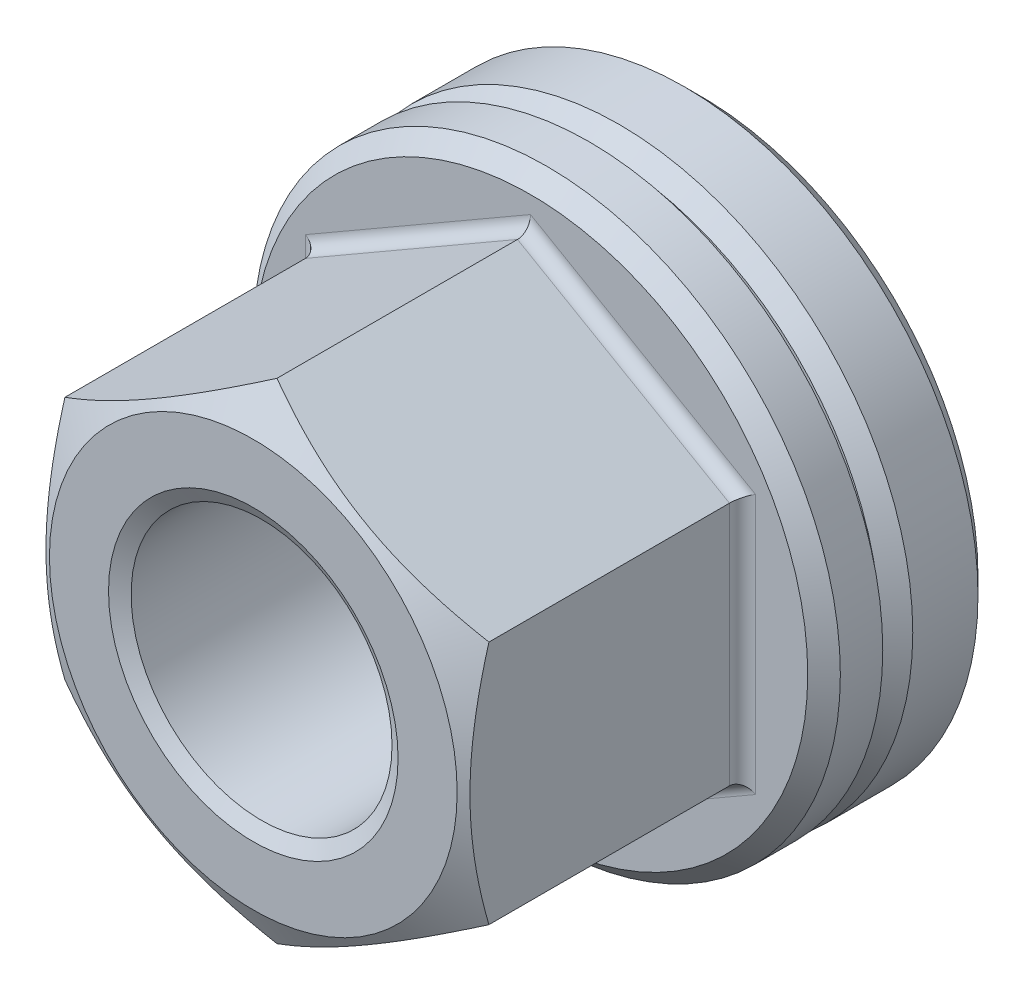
ISO-10303-21;
HEADER;
FILE_DESCRIPTION(('STEP AP214'),'2;1');
FILE_NAME('part.step','',(''),(''),'','','');
FILE_SCHEMA(('AUTOMOTIVE_DESIGN { 1 0 10303 214 1 1 1 1 }'));
ENDSEC;
DATA;
#1=APPLICATION_CONTEXT('core data for automotive mechanical design processes');
#2=APPLICATION_PROTOCOL_DEFINITION('international standard','automotive_design',2000,#1);
#3=PRODUCT_CONTEXT('',#1,'mechanical');
#4=PRODUCT('Part','Part','',(#3));
#5=PRODUCT_RELATED_PRODUCT_CATEGORY('part','',(#4));
#6=PRODUCT_DEFINITION_FORMATION('','',#4);
#7=PRODUCT_DEFINITION_CONTEXT('part definition',#1,'design');
#8=PRODUCT_DEFINITION('design','',#6,#7);
#9=PRODUCT_DEFINITION_SHAPE('','',#8);
#10=(LENGTH_UNIT() NAMED_UNIT(*) SI_UNIT(.MILLI.,.METRE.));
#11=(NAMED_UNIT(*) PLANE_ANGLE_UNIT() SI_UNIT($,.RADIAN.));
#12=(NAMED_UNIT(*) SI_UNIT($,.STERADIAN.) SOLID_ANGLE_UNIT());
#13=UNCERTAINTY_MEASURE_WITH_UNIT(LENGTH_MEASURE(1.E-05),#10,'distance_accuracy_value','');
#14=(GEOMETRIC_REPRESENTATION_CONTEXT(3) GLOBAL_UNCERTAINTY_ASSIGNED_CONTEXT((#13)) GLOBAL_UNIT_ASSIGNED_CONTEXT((#10,
#11,#12)) REPRESENTATION_CONTEXT('',''));
#15=CARTESIAN_POINT('',(0.,0.,0.));
#16=DIRECTION('',(0.,0.,1.));
#17=DIRECTION('',(1.,0.,0.));
#18=AXIS2_PLACEMENT_3D('',#15,#16,#17);
#19=CARTESIAN_POINT('',(0.,0.,3.));
#20=DIRECTION('',(0.,0.,1.));
#21=DIRECTION('',(1.,0.,0.));
#22=AXIS2_PLACEMENT_3D('',#19,#20,#21);
#23=PLANE('',#22);
#24=CARTESIAN_POINT('',(0.,0.,3.));
#25=DIRECTION('',(0.,0.,1.));
#26=DIRECTION('',(1.,0.,0.));
#27=AXIS2_PLACEMENT_3D('',#24,#25,#26);
#28=CIRCLE('',#27,8.5);
#29=CARTESIAN_POINT('',(8.5,0.,3.));
#30=VERTEX_POINT('',#29);
#31=EDGE_CURVE('E558',#30,#30,#28,.T.);
#32=ORIENTED_EDGE('',*,*,#31,.T.);
#33=EDGE_LOOP('',(#32));
#34=FACE_BOUND('',#33,.T.);
#35=CARTESIAN_POINT('',(0.,0.,3.));
#36=DIRECTION('',(0.,0.,1.));
#37=DIRECTION('',(1.,0.,0.));
#38=AXIS2_PLACEMENT_3D('',#35,#36,#37);
#39=CIRCLE('',#38,8.11247891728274);
#40=CARTESIAN_POINT('',(0.,8.1124789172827,3.));
#41=VERTEX_POINT('',#40);
#42=EDGE_CURVE('E9',#41,#41,#39,.F.);
#43=ORIENTED_EDGE('',*,*,#42,.T.);
#44=EDGE_LOOP('',(#43));
#45=FACE_BOUND('',#44,.T.);
#46=ADVANCED_FACE('F14',(#34,#45),#23,.T.);
#47=CARTESIAN_POINT('',(0.,0.,27.0416305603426));
#48=DIRECTION('',(0.,0.,-1.));
#49=DIRECTION('',(-1.,0.,0.));
#50=AXIS2_PLACEMENT_3D('',#47,#48,#49);
#51=CYLINDRICAL_SURFACE('',#50,5.25);
#52=CARTESIAN_POINT('',(0.,0.,1.90808929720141));
#53=DIRECTION('',(0.,0.,1.));
#54=DIRECTION('',(1.,0.,0.));
#55=AXIS2_PLACEMENT_3D('',#52,#53,#54);
#56=CIRCLE('',#55,5.25);
#57=CARTESIAN_POINT('',(5.25,0.,1.90808929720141));
#58=VERTEX_POINT('',#57);
#59=EDGE_CURVE('E153',#58,#58,#56,.T.);
#60=ORIENTED_EDGE('',*,*,#59,.F.);
#61=EDGE_LOOP('',(#60));
#62=FACE_BOUND('',#61,.T.);
#63=CARTESIAN_POINT('',(0.,0.,1.9821611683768));
#64=DIRECTION('',(0.,0.,1.));
#65=DIRECTION('',(1.,0.,0.));
#66=AXIS2_PLACEMENT_3D('',#63,#64,#65);
#67=CIRCLE('',#66,5.25);
#68=CARTESIAN_POINT('',(0.,5.24999999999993,1.9821611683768));
#69=VERTEX_POINT('',#68);
#70=EDGE_CURVE('E22',#69,#69,#67,.F.);
#71=ORIENTED_EDGE('',*,*,#70,.F.);
#72=EDGE_LOOP('',(#71));
#73=FACE_BOUND('',#72,.T.);
#74=ADVANCED_FACE('F418',(#62,#73),#51,.F.);
#75=CARTESIAN_POINT('',(0.,0.,1.7261041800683));
#76=DIRECTION('',(0.,0.,1.));
#77=DIRECTION('',(1.,0.,0.));
#78=AXIS2_PLACEMENT_3D('',#75,#76,#77);
#79=CONICAL_SURFACE('',#78,4.75,1.22173047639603);
#80=CARTESIAN_POINT('',(0.,0.,1.7261041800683));
#81=DIRECTION('',(0.,0.,1.));
#82=DIRECTION('',(1.,0.,0.));
#83=AXIS2_PLACEMENT_3D('',#80,#81,#82);
#84=CIRCLE('',#83,4.75);
#85=CARTESIAN_POINT('',(4.75,0.,1.7261041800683));
#86=VERTEX_POINT('',#85);
#87=EDGE_CURVE('E577',#86,#86,#84,.T.);
#88=ORIENTED_EDGE('',*,*,#87,.F.);
#89=EDGE_LOOP('',(#88));
#90=FACE_BOUND('',#89,.T.);
#91=ORIENTED_EDGE('',*,*,#59,.T.);
#92=EDGE_LOOP('',(#91));
#93=FACE_BOUND('',#92,.T.);
#94=ADVANCED_FACE('F409',(#90,#93),#79,.F.);
#95=CARTESIAN_POINT('',(0.,0.,0.));
#96=DIRECTION('',(0.,0.,1.));
#97=DIRECTION('',(1.,0.,0.));
#98=AXIS2_PLACEMENT_3D('',#95,#96,#97);
#99=PLANE('',#98);
#100=CARTESIAN_POINT('',(0.,0.,0.));
#101=DIRECTION('',(0.,0.,1.));
#102=DIRECTION('',(1.,0.,0.));
#103=AXIS2_PLACEMENT_3D('',#100,#101,#102);
#104=CIRCLE('',#103,5.25);
#105=CARTESIAN_POINT('',(5.25,0.,0.));
#106=VERTEX_POINT('',#105);
#107=EDGE_CURVE('E571',#106,#106,#104,.T.);
#108=ORIENTED_EDGE('',*,*,#107,.T.);
#109=EDGE_LOOP('',(#108));
#110=FACE_BOUND('',#109,.T.);
#111=CARTESIAN_POINT('',(0.,0.,0.));
#112=DIRECTION('',(0.,0.,1.));
#113=DIRECTION('',(1.,0.,0.));
#114=AXIS2_PLACEMENT_3D('',#111,#112,#113);
#115=CIRCLE('',#114,8.5);
#116=CARTESIAN_POINT('',(8.5,0.,0.));
#117=VERTEX_POINT('',#116);
#118=EDGE_CURVE('E574',#117,#117,#115,.F.);
#119=ORIENTED_EDGE('',*,*,#118,.T.);
#120=EDGE_LOOP('',(#119));
#121=FACE_BOUND('',#120,.T.);
#122=ADVANCED_FACE('F400',(#110,#121),#99,.F.);
#123=CARTESIAN_POINT('',(0.,0.,3.));
#124=DIRECTION('',(0.,0.,-1.));
#125=DIRECTION('',(-1.,0.,0.));
#126=AXIS2_PLACEMENT_3D('',#123,#124,#125);
#127=CYLINDRICAL_SURFACE('',#126,9.);
#128=CARTESIAN_POINT('',(0.,0.,0.5));
#129=DIRECTION('',(0.,0.,1.));
#130=DIRECTION('',(1.,0.,0.));
#131=AXIS2_PLACEMENT_3D('',#128,#129,#130);
#132=CIRCLE('',#131,9.);
#133=CARTESIAN_POINT('',(9.,0.,0.5));
#134=VERTEX_POINT('',#133);
#135=EDGE_CURVE('E560',#134,#134,#132,.T.);
#136=ORIENTED_EDGE('',*,*,#135,.T.);
#137=EDGE_LOOP('',(#136));
#138=FACE_BOUND('',#137,.T.);
#139=CARTESIAN_POINT('',(0.,0.,2.5));
#140=DIRECTION('',(0.,0.,1.));
#141=DIRECTION('',(1.,0.,0.));
#142=AXIS2_PLACEMENT_3D('',#139,#140,#141);
#143=CIRCLE('',#142,9.);
#144=CARTESIAN_POINT('',(9.,0.,2.5));
#145=VERTEX_POINT('',#144);
#146=EDGE_CURVE('E563',#145,#145,#143,.F.);
#147=ORIENTED_EDGE('',*,*,#146,.T.);
#148=EDGE_LOOP('',(#147));
#149=FACE_BOUND('',#148,.T.);
#150=ADVANCED_FACE('F391',(#138,#149),#127,.T.);
#151=CARTESIAN_POINT('',(0.,0.,4.16940303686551));
#152=DIRECTION('',(0.,0.,1.));
#153=DIRECTION('',(1.,0.,0.));
#154=AXIS2_PLACEMENT_3D('',#151,#152,#153);
#155=CYLINDRICAL_SURFACE('',#154,4.75);
#156=CARTESIAN_POINT('',(0.,0.,0.500000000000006));
#157=DIRECTION('',(0.,0.,1.));
#158=DIRECTION('',(1.,0.,0.));
#159=AXIS2_PLACEMENT_3D('',#156,#157,#158);
#160=CIRCLE('',#159,4.75);
#161=CARTESIAN_POINT('',(4.75,0.,0.500000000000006));
#162=VERTEX_POINT('',#161);
#163=EDGE_CURVE('E568',#162,#162,#160,.F.);
#164=ORIENTED_EDGE('',*,*,#163,.T.);
#165=EDGE_LOOP('',(#164));
#166=FACE_BOUND('',#165,.T.);
#167=ORIENTED_EDGE('',*,*,#87,.T.);
#168=EDGE_LOOP('',(#167));
#169=FACE_BOUND('',#168,.T.);
#170=ADVANCED_FACE('F382',(#166,#169),#155,.F.);
#171=CARTESIAN_POINT('',(0.,0.,0.));
#172=DIRECTION('',(0.,0.,-1.));
#173=DIRECTION('',(-1.,0.,0.));
#174=AXIS2_PLACEMENT_3D('',#171,#172,#173);
#175=CONICAL_SURFACE('',#174,5.25,0.785398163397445);
#176=ORIENTED_EDGE('',*,*,#163,.F.);
#177=EDGE_LOOP('',(#176));
#178=FACE_BOUND('',#177,.T.);
#179=ORIENTED_EDGE('',*,*,#107,.F.);
#180=EDGE_LOOP('',(#179));
#181=FACE_BOUND('',#180,.T.);
#182=ADVANCED_FACE('F373',(#178,#181),#175,.F.);
#183=CARTESIAN_POINT('',(0.,0.,0.5));
#184=DIRECTION('',(0.,0.,1.));
#185=DIRECTION('',(1.,0.,0.));
#186=AXIS2_PLACEMENT_3D('',#183,#184,#185);
#187=CONICAL_SURFACE('',#186,9.,0.785398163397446);
#188=ORIENTED_EDGE('',*,*,#118,.F.);
#189=EDGE_LOOP('',(#188));
#190=FACE_BOUND('',#189,.T.);
#191=ORIENTED_EDGE('',*,*,#135,.F.);
#192=EDGE_LOOP('',(#191));
#193=FACE_BOUND('',#192,.T.);
#194=ADVANCED_FACE('F364',(#190,#193),#187,.T.);
#195=CARTESIAN_POINT('',(0.,0.,3.));
#196=DIRECTION('',(0.,0.,-1.));
#197=DIRECTION('',(-1.,0.,0.));
#198=AXIS2_PLACEMENT_3D('',#195,#196,#197);
#199=CONICAL_SURFACE('',#198,8.5,0.785398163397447);
#200=ORIENTED_EDGE('',*,*,#146,.F.);
#201=EDGE_LOOP('',(#200));
#202=FACE_BOUND('',#201,.T.);
#203=ORIENTED_EDGE('',*,*,#31,.F.);
#204=EDGE_LOOP('',(#203));
#205=FACE_BOUND('',#204,.T.);
#206=ADVANCED_FACE('F219',(#202,#205),#199,.T.);
#207=CARTESIAN_POINT('',(-6.5,-3.75277674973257,13.7202299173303));
#208=DIRECTION('',(0.5,0.866025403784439,0.));
#209=DIRECTION('',(-0.866025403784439,0.5,0.));
#210=AXIS2_PLACEMENT_3D('',#207,#208,#209);
#211=PLANE('',#210);
#212=DIRECTION('',(0.,0.,-1.));
#213=VECTOR('',#212,1.);
#214=CARTESIAN_POINT('',(-6.5,-3.75277674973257,13.7202299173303));
#215=LINE('',#214,#213);
#216=CARTESIAN_POINT('',(-6.5,-3.75277674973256,12.9956553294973));
#217=VERTEX_POINT('',#216);
#218=CARTESIAN_POINT('',(-6.5,-3.75277674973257,5.62022991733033));
#219=VERTEX_POINT('',#218);
#220=EDGE_CURVE('E105',#217,#219,#215,.T.);
#221=ORIENTED_EDGE('',*,*,#220,.T.);
#222=DIRECTION('',(0.866025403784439,-0.5,0.));
#223=VECTOR('',#222,1.);
#224=CARTESIAN_POINT('',(-6.5,-3.75277674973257,5.62022991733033));
#225=LINE('',#224,#223);
#226=CARTESIAN_POINT('',(0.,-7.50555349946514,5.62022991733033));
#227=VERTEX_POINT('',#226);
#228=EDGE_CURVE('E147',#219,#227,#225,.T.);
#229=ORIENTED_EDGE('',*,*,#228,.T.);
#230=DIRECTION('',(0.,0.,-1.));
#231=VECTOR('',#230,1.);
#232=CARTESIAN_POINT('',(0.,-7.50555349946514,13.7202299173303));
#233=LINE('',#232,#231);
#234=CARTESIAN_POINT('',(0.,-7.50555349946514,12.9956553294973));
#235=VERTEX_POINT('',#234);
#236=EDGE_CURVE('E116',#235,#227,#233,.T.);
#237=ORIENTED_EDGE('',*,*,#236,.F.);
#238=CARTESIAN_POINT('',(0.000199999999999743,-7.50566896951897,12.9955886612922));
#239=CARTESIAN_POINT('',(-0.14267745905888,-7.4231786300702,13.0432074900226));
#240=CARTESIAN_POINT('',(-0.286087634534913,-7.34038072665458,13.0886652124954));
#241=CARTESIAN_POINT('',(-0.574072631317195,-7.17411251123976,13.1746632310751));
#242=CARTESIAN_POINT('',(-0.718647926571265,-7.09064192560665,13.2152014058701));
#243=CARTESIAN_POINT('',(-1.15468865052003,-6.83889369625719,13.3286409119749));
#244=CARTESIAN_POINT('',(-1.44787528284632,-6.66962231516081,13.3931641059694));
#245=CARTESIAN_POINT('',(-1.88662374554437,-6.41631077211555,13.4688253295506));
#246=CARTESIAN_POINT('',(-2.03087463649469,-6.33302748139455,13.4903790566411));
#247=CARTESIAN_POINT('',(-2.32002821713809,-6.16608458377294,13.526521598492));
#248=CARTESIAN_POINT('',(-2.46493084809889,-6.08242501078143,13.5411110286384));
#249=CARTESIAN_POINT('',(-2.75498777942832,-5.91496056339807,13.5629531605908));
#250=CARTESIAN_POINT('',(-2.90014160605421,-5.83115596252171,13.570214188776));
#251=CARTESIAN_POINT('',(-3.19057533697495,-5.66347396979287,13.5772516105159));
#252=CARTESIAN_POINT('',(-3.33585523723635,-5.5795965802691,13.5770282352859));
#253=CARTESIAN_POINT('',(-3.73387594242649,-5.34979921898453,13.5661284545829));
#254=CARTESIAN_POINT('',(-3.98648646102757,-5.20395446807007,13.5478300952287));
#255=CARTESIAN_POINT('',(-4.49002967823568,-4.91323365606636,13.4898055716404));
#256=CARTESIAN_POINT('',(-4.74096060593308,-4.76835861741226,13.4500595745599));
#257=CARTESIAN_POINT('',(-5.24551722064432,-4.47705272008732,13.350706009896));
#258=CARTESIAN_POINT('',(-5.49907924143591,-4.33065861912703,13.2906774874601));
#259=CARTESIAN_POINT('',(-6.00242193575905,-4.04005357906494,13.1544369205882));
#260=CARTESIAN_POINT('',(-6.25220905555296,-3.89583891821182,13.0782568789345));
#261=CARTESIAN_POINT('',(-6.5002,-3.75266127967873,12.9955886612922));
#262=B_SPLINE_CURVE_WITH_KNOTS('',3,(#238,#239,#240,#241,#242,#243,#244,#245,#246,#247,#248,
#249,#250,#251,#252,#253,#254,#255,#256,#257,#258,#259,#260,#261),.UNSPECIFIED.,.F.,.F.,(4,2,2,
2,2,2,2,2,2,2,2,4),(0.,0.515105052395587,1.03043143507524,2.06322554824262,2.56697389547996,
3.07067772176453,3.57380860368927,4.07692394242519,4.9527935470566,5.82947446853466,
6.72559912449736,7.61996451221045),.UNSPECIFIED.);
#263=EDGE_CURVE('E106',#235,#217,#262,.T.);
#264=ORIENTED_EDGE('',*,*,#263,.T.);
#265=EDGE_LOOP('',(#221,#229,#237,#264));
#266=FACE_BOUND('',#265,.T.);
#267=ADVANCED_FACE('F215',(#266),#211,.F.);
#268=CARTESIAN_POINT('',(0.,-7.50555349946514,13.7202299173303));
#269=DIRECTION('',(-0.5,0.866025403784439,0.));
#270=DIRECTION('',(-0.866025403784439,-0.5,0.));
#271=AXIS2_PLACEMENT_3D('',#268,#269,#270);
#272=PLANE('',#271);
#273=ORIENTED_EDGE('',*,*,#236,.T.);
#274=DIRECTION('',(0.866025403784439,0.5,0.));
#275=VECTOR('',#274,1.);
#276=CARTESIAN_POINT('',(0.,-7.50555349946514,5.62022991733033));
#277=LINE('',#276,#275);
#278=CARTESIAN_POINT('',(6.5,-3.75277674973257,5.62022991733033));
#279=VERTEX_POINT('',#278);
#280=EDGE_CURVE('E37',#227,#279,#277,.T.);
#281=ORIENTED_EDGE('',*,*,#280,.T.);
#282=DIRECTION('',(0.,0.,-1.));
#283=VECTOR('',#282,1.);
#284=CARTESIAN_POINT('',(6.5,-3.75277674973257,13.7202299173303));
#285=LINE('',#284,#283);
#286=CARTESIAN_POINT('',(6.5,-3.75277674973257,12.9956553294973));
#287=VERTEX_POINT('',#286);
#288=EDGE_CURVE('E307',#287,#279,#285,.T.);
#289=ORIENTED_EDGE('',*,*,#288,.F.);
#290=CARTESIAN_POINT('',(6.5002,-3.75266127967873,12.9955886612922));
#291=CARTESIAN_POINT('',(6.35732254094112,-3.83515161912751,13.0432074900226));
#292=CARTESIAN_POINT('',(6.21391236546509,-3.91794952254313,13.0886652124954));
#293=CARTESIAN_POINT('',(5.92592736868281,-4.08421773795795,13.1746632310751));
#294=CARTESIAN_POINT('',(5.78135207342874,-4.16768832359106,13.2152014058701));
#295=CARTESIAN_POINT('',(5.34531134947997,-4.41943655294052,13.3286409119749));
#296=CARTESIAN_POINT('',(5.05212471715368,-4.5887079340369,13.3931641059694));
#297=CARTESIAN_POINT('',(4.61337625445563,-4.84201947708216,13.4688253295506));
#298=CARTESIAN_POINT('',(4.46912536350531,-4.92530276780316,13.4903790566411));
#299=CARTESIAN_POINT('',(4.17997178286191,-5.09224566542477,13.526521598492));
#300=CARTESIAN_POINT('',(4.03506915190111,-5.17590523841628,13.5411110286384));
#301=CARTESIAN_POINT('',(3.74501222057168,-5.34336968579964,13.5629531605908));
#302=CARTESIAN_POINT('',(3.59985839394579,-5.427174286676,13.570214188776));
#303=CARTESIAN_POINT('',(3.30942466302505,-5.59485627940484,13.5772516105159));
#304=CARTESIAN_POINT('',(3.16414476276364,-5.6787336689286,13.5770282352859));
#305=CARTESIAN_POINT('',(2.76612405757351,-5.90853103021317,13.5661284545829));
#306=CARTESIAN_POINT('',(2.51351353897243,-6.05437578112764,13.5478300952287));
#307=CARTESIAN_POINT('',(2.00997032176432,-6.34509659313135,13.4898055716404));
#308=CARTESIAN_POINT('',(1.75903939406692,-6.48997163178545,13.4500595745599));
#309=CARTESIAN_POINT('',(1.25448277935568,-6.78127752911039,13.350706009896));
#310=CARTESIAN_POINT('',(1.00092075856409,-6.92767163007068,13.2906774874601));
#311=CARTESIAN_POINT('',(0.497578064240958,-7.21827667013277,13.1544369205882));
#312=CARTESIAN_POINT('',(0.247790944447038,-7.36249133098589,13.0782568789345));
#313=CARTESIAN_POINT('',(-0.000200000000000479,-7.50566896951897,12.9955886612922));
#314=B_SPLINE_CURVE_WITH_KNOTS('',3,(#290,#291,#292,#293,#294,#295,#296,#297,#298,#299,#300,
#301,#302,#303,#304,#305,#306,#307,#308,#309,#310,#311,#312,#313),.UNSPECIFIED.,.F.,.F.,(4,2,2,
2,2,2,2,2,2,2,2,4),(0.,0.515105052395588,1.03043143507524,2.06322554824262,2.56697389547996,
3.07067772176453,3.57380860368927,4.0769239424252,4.9527935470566,5.82947446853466,
6.72559912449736,7.61996451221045),.UNSPECIFIED.);
#315=EDGE_CURVE('E196',#287,#235,#314,.T.);
#316=ORIENTED_EDGE('',*,*,#315,.T.);
#317=EDGE_LOOP('',(#273,#281,#289,#316));
#318=FACE_BOUND('',#317,.T.);
#319=ADVANCED_FACE('F210',(#318),#272,.F.);
#320=CARTESIAN_POINT('',(6.5,-3.75277674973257,13.7202299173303));
#321=DIRECTION('',(-1.,0.,0.));
#322=DIRECTION('',(0.,-1.,0.));
#323=AXIS2_PLACEMENT_3D('',#320,#321,#322);
#324=PLANE('',#323);
#325=ORIENTED_EDGE('',*,*,#288,.T.);
#326=DIRECTION('',(0.,1.,0.));
#327=VECTOR('',#326,1.);
#328=CARTESIAN_POINT('',(6.5,-3.75277674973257,5.62022991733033));
#329=LINE('',#328,#327);
#330=CARTESIAN_POINT('',(6.5,3.75277674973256,5.62022991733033));
#331=VERTEX_POINT('',#330);
#332=EDGE_CURVE('E29',#279,#331,#329,.T.);
#333=ORIENTED_EDGE('',*,*,#332,.T.);
#334=DIRECTION('',(0.,0.,-1.));
#335=VECTOR('',#334,1.);
#336=CARTESIAN_POINT('',(6.5,3.75277674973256,13.7202299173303));
#337=LINE('',#336,#335);
#338=CARTESIAN_POINT('',(6.5,3.75277674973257,12.9956553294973));
#339=VERTEX_POINT('',#338);
#340=EDGE_CURVE('E306',#339,#331,#337,.T.);
#341=ORIENTED_EDGE('',*,*,#340,.F.);
#342=CARTESIAN_POINT('',(6.5,-9.93295537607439,10.4754347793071));
#343=CARTESIAN_POINT('',(6.5,-9.6477234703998,10.6131915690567));
#344=CARTESIAN_POINT('',(6.5,-9.36181491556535,10.7495728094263));
#345=CARTESIAN_POINT('',(6.5,-8.78827855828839,11.0187976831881));
#346=CARTESIAN_POINT('',(6.5,-8.50065046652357,11.1516406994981));
#347=CARTESIAN_POINT('',(6.5,-7.92174543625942,11.4137068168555));
#348=CARTESIAN_POINT('',(6.5,-7.63045702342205,11.542904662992));
#349=CARTESIAN_POINT('',(6.5,-7.04547864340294,11.7957221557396));
#350=CARTESIAN_POINT('',(6.5,-6.751788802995,11.9193420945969));
#351=CARTESIAN_POINT('',(6.5,-6.1579877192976,12.1609492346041));
#352=CARTESIAN_POINT('',(6.5,-5.85784168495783,12.2788513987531));
#353=CARTESIAN_POINT('',(6.5,-5.25400207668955,12.505371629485));
#354=CARTESIAN_POINT('',(6.5,-4.95030811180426,12.6139886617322));
#355=CARTESIAN_POINT('',(6.5,-4.3395210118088,12.8190058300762));
#356=CARTESIAN_POINT('',(6.5,-4.03243674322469,12.9154321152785));
#357=CARTESIAN_POINT('',(6.5,-3.41390034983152,13.0929221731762));
#358=CARTESIAN_POINT('',(6.5,-3.10244964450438,13.1739908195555));
#359=CARTESIAN_POINT('',(6.5,-2.47497467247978,13.3168233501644));
#360=CARTESIAN_POINT('',(6.5,-2.1589489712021,13.3785810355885));
#361=CARTESIAN_POINT('',(6.5,-1.52306565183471,13.4786007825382));
#362=CARTESIAN_POINT('',(6.5,-1.20320802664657,13.5168628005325));
#363=CARTESIAN_POINT('',(6.5,-0.722924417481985,13.5541808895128));
#364=CARTESIAN_POINT('',(6.5,-0.563237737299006,13.5632769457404));
#365=CARTESIAN_POINT('',(6.5,-0.243615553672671,13.5747045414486));
#366=CARTESIAN_POINT('',(6.5,-0.0836800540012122,13.5770361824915));
#367=CARTESIAN_POINT('',(6.5,0.23609888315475,13.5748717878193));
#368=CARTESIAN_POINT('',(6.5,0.395942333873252,13.5703776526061));
#369=CARTESIAN_POINT('',(6.5,0.715301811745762,13.5546749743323));
#370=CARTESIAN_POINT('',(6.5,0.87481782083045,13.5434660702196));
#371=CARTESIAN_POINT('',(6.5,1.26196060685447,13.5083459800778));
#372=CARTESIAN_POINT('',(6.5,1.4892854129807,13.4810411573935));
#373=CARTESIAN_POINT('',(6.5,1.94214079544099,13.4143187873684));
#374=CARTESIAN_POINT('',(6.5,2.16767109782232,13.3748994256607));
#375=CARTESIAN_POINT('',(6.5,2.8419702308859,13.2404479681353));
#376=CARTESIAN_POINT('',(6.5,3.28756464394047,13.1293127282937));
#377=CARTESIAN_POINT('',(6.5,3.9540602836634,12.9378502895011));
#378=CARTESIAN_POINT('',(6.5,4.17844803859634,12.8689727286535));
#379=CARTESIAN_POINT('',(6.5,4.62505588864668,12.7243905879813));
#380=CARTESIAN_POINT('',(6.5,4.84727578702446,12.6486853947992));
#381=CARTESIAN_POINT('',(6.5,5.28843848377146,12.4920671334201));
#382=CARTESIAN_POINT('',(6.5,5.50739270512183,12.4111859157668));
#383=CARTESIAN_POINT('',(6.5,5.94344047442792,12.2447652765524));
#384=CARTESIAN_POINT('',(6.5,6.16053463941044,12.159227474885));
#385=CARTESIAN_POINT('',(6.5,6.37684606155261,12.0717978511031));
#386=B_SPLINE_CURVE_WITH_KNOTS('',3,(#342,#343,#344,#345,#346,#347,#348,#349,#350,#351,#352,
#353,#354,#355,#356,#357,#358,#359,#360,#361,#362,#363,#364,#365,#366,#367,#368,#369,#370,#371,
#372,#373,#374,#375,#376,#377,#378,#379,#380,#381,#382,#383,#384,#385),.UNSPECIFIED.,.F.,.F.,(4,
2,2,2,2,2,2,2,2,2,2,2,2,2,2,2,2,2,2,2,2,4),(0.,0.950279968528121,1.90072459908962,
2.85664319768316,3.81251165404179,4.7798108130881,5.74721758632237,6.71251273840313,
7.67750104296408,8.64279879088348,9.60809832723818,10.0878131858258,10.5675208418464,
11.0470949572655,11.5266948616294,12.2131808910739,12.8997697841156,14.2755974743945,
14.9797065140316,15.6838788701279,16.3840715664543,17.0840222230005),.UNSPECIFIED.);
#387=EDGE_CURVE('E187',#339,#287,#386,.F.);
#388=ORIENTED_EDGE('',*,*,#387,.T.);
#389=EDGE_LOOP('',(#325,#333,#341,#388));
#390=FACE_BOUND('',#389,.T.);
#391=ADVANCED_FACE('F206',(#390),#324,.F.);
#392=CARTESIAN_POINT('',(6.5,3.75277674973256,13.7202299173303));
#393=DIRECTION('',(-0.5,-0.866025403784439,0.));
#394=DIRECTION('',(0.866025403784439,-0.5,0.));
#395=AXIS2_PLACEMENT_3D('',#392,#393,#394);
#396=PLANE('',#395);
#397=ORIENTED_EDGE('',*,*,#340,.T.);
#398=DIRECTION('',(-0.866025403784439,0.5,0.));
#399=VECTOR('',#398,1.);
#400=CARTESIAN_POINT('',(6.5,3.75277674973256,5.62022991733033));
#401=LINE('',#400,#399);
#402=CARTESIAN_POINT('',(0.,7.50555349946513,5.62022991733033));
#403=VERTEX_POINT('',#402);
#404=EDGE_CURVE('E151',#331,#403,#401,.T.);
#405=ORIENTED_EDGE('',*,*,#404,.T.);
#406=DIRECTION('',(0.,0.,-1.));
#407=VECTOR('',#406,1.);
#408=CARTESIAN_POINT('',(0.,7.50555349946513,13.7202299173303));
#409=LINE('',#408,#407);
#410=CARTESIAN_POINT('',(0.,7.50555349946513,12.9956553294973));
#411=VERTEX_POINT('',#410);
#412=EDGE_CURVE('E112',#411,#403,#409,.T.);
#413=ORIENTED_EDGE('',*,*,#412,.F.);
#414=CARTESIAN_POINT('',(-0.000199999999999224,7.50566896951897,12.9955886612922));
#415=CARTESIAN_POINT('',(0.14267745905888,7.4231786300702,13.0432074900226));
#416=CARTESIAN_POINT('',(0.286087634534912,7.34038072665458,13.0886652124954));
#417=CARTESIAN_POINT('',(0.574072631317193,7.17411251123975,13.1746632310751));
#418=CARTESIAN_POINT('',(0.718647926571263,7.09064192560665,13.2152014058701));
#419=CARTESIAN_POINT('',(1.15468865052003,6.83889369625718,13.3286409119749));
#420=CARTESIAN_POINT('',(1.44787528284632,6.6696223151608,13.3931641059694));
#421=CARTESIAN_POINT('',(1.88662374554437,6.41631077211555,13.4688253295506));
#422=CARTESIAN_POINT('',(2.03087463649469,6.33302748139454,13.4903790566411));
#423=CARTESIAN_POINT('',(2.32002821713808,6.16608458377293,13.526521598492));
#424=CARTESIAN_POINT('',(2.46493084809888,6.08242501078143,13.5411110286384));
#425=CARTESIAN_POINT('',(2.75498777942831,5.91496056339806,13.5629531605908));
#426=CARTESIAN_POINT('',(2.9001416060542,5.8311559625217,13.570214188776));
#427=CARTESIAN_POINT('',(3.19057533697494,5.66347396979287,13.5772516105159));
#428=CARTESIAN_POINT('',(3.33585523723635,5.5795965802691,13.5770282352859));
#429=CARTESIAN_POINT('',(3.73387594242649,5.34979921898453,13.5661284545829));
#430=CARTESIAN_POINT('',(3.98648646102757,5.20395446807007,13.5478300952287));
#431=CARTESIAN_POINT('',(4.49002967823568,4.91323365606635,13.4898055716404));
#432=CARTESIAN_POINT('',(4.74096060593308,4.76835861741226,13.4500595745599));
#433=CARTESIAN_POINT('',(5.24551722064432,4.47705272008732,13.350706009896));
#434=CARTESIAN_POINT('',(5.49907924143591,4.33065861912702,13.2906774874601));
#435=CARTESIAN_POINT('',(6.00242193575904,4.04005357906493,13.1544369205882));
#436=CARTESIAN_POINT('',(6.25220905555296,3.89583891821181,13.0782568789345));
#437=CARTESIAN_POINT('',(6.5002,3.75266127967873,12.9955886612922));
#438=B_SPLINE_CURVE_WITH_KNOTS('',3,(#414,#415,#416,#417,#418,#419,#420,#421,#422,#423,#424,
#425,#426,#427,#428,#429,#430,#431,#432,#433,#434,#435,#436,#437),.UNSPECIFIED.,.F.,.F.,(4,2,2,
2,2,2,2,2,2,2,2,4),(0.,0.515105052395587,1.03043143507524,2.06322554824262,2.56697389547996,
3.07067772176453,3.57380860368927,4.07692394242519,4.9527935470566,5.82947446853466,
6.72559912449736,7.61996451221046),.UNSPECIFIED.);
#439=EDGE_CURVE('E93',#411,#339,#438,.T.);
#440=ORIENTED_EDGE('',*,*,#439,.T.);
#441=EDGE_LOOP('',(#397,#405,#413,#440));
#442=FACE_BOUND('',#441,.T.);
#443=ADVANCED_FACE('F209',(#442),#396,.F.);
#444=CARTESIAN_POINT('',(0.,7.50555349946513,13.7202299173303));
#445=DIRECTION('',(0.5,-0.866025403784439,0.));
#446=DIRECTION('',(0.866025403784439,0.5,0.));
#447=AXIS2_PLACEMENT_3D('',#444,#445,#446);
#448=PLANE('',#447);
#449=ORIENTED_EDGE('',*,*,#412,.T.);
#450=DIRECTION('',(-0.866025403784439,-0.5,0.));
#451=VECTOR('',#450,1.);
#452=CARTESIAN_POINT('',(0.,7.50555349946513,5.62022991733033));
#453=LINE('',#452,#451);
#454=CARTESIAN_POINT('',(-6.5,3.75277674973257,5.62022991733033));
#455=VERTEX_POINT('',#454);
#456=EDGE_CURVE('E111',#403,#455,#453,.T.);
#457=ORIENTED_EDGE('',*,*,#456,.T.);
#458=DIRECTION('',(0.,0.,-1.));
#459=VECTOR('',#458,1.);
#460=CARTESIAN_POINT('',(-6.5,3.75277674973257,13.7202299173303));
#461=LINE('',#460,#459);
#462=CARTESIAN_POINT('',(-6.5,3.75277674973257,12.9956553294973));
#463=VERTEX_POINT('',#462);
#464=EDGE_CURVE('E103',#463,#455,#461,.T.);
#465=ORIENTED_EDGE('',*,*,#464,.F.);
#466=CARTESIAN_POINT('',(-6.5002,3.75266127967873,12.9955886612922));
#467=CARTESIAN_POINT('',(-6.35732254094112,3.8351516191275,13.0432074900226));
#468=CARTESIAN_POINT('',(-6.21391236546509,3.91794952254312,13.0886652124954));
#469=CARTESIAN_POINT('',(-5.9259273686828,4.08421773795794,13.1746632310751));
#470=CARTESIAN_POINT('',(-5.78135207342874,4.16768832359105,13.2152014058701));
#471=CARTESIAN_POINT('',(-5.34531134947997,4.41943655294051,13.3286409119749));
#472=CARTESIAN_POINT('',(-5.05212471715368,4.58870793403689,13.3931641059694));
#473=CARTESIAN_POINT('',(-4.61337625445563,4.84201947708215,13.4688253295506));
#474=CARTESIAN_POINT('',(-4.46912536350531,4.92530276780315,13.4903790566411));
#475=CARTESIAN_POINT('',(-4.17997178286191,5.09224566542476,13.526521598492));
#476=CARTESIAN_POINT('',(-4.03506915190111,5.17590523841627,13.5411110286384));
#477=CARTESIAN_POINT('',(-3.74501222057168,5.34336968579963,13.5629531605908));
#478=CARTESIAN_POINT('',(-3.59985839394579,5.42717428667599,13.570214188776));
#479=CARTESIAN_POINT('',(-3.30942466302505,5.59485627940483,13.5772516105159));
#480=CARTESIAN_POINT('',(-3.16414476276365,5.6787336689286,13.5770282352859));
#481=CARTESIAN_POINT('',(-2.76612405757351,5.90853103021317,13.5661284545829));
#482=CARTESIAN_POINT('',(-2.51351353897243,6.05437578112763,13.5478300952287));
#483=CARTESIAN_POINT('',(-2.00997032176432,6.34509659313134,13.4898055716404));
#484=CARTESIAN_POINT('',(-1.75903939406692,6.48997163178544,13.4500595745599));
#485=CARTESIAN_POINT('',(-1.25448277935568,6.78127752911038,13.350706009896));
#486=CARTESIAN_POINT('',(-1.00092075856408,6.92767163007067,13.2906774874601));
#487=CARTESIAN_POINT('',(-0.497578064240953,7.21827667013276,13.1544369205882));
#488=CARTESIAN_POINT('',(-0.247790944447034,7.36249133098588,13.0782568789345));
#489=CARTESIAN_POINT('',(0.000200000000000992,7.50566896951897,12.9955886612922));
#490=B_SPLINE_CURVE_WITH_KNOTS('',3,(#466,#467,#468,#469,#470,#471,#472,#473,#474,#475,#476,
#477,#478,#479,#480,#481,#482,#483,#484,#485,#486,#487,#488,#489),.UNSPECIFIED.,.F.,.F.,(4,2,2,
2,2,2,2,2,2,2,2,4),(0.,0.515105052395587,1.03043143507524,2.06322554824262,2.56697389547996,
3.07067772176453,3.57380860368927,4.07692394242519,4.9527935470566,5.82947446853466,
6.72559912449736,7.61996451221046),.UNSPECIFIED.);
#491=EDGE_CURVE('E87',#463,#411,#490,.T.);
#492=ORIENTED_EDGE('',*,*,#491,.T.);
#493=EDGE_LOOP('',(#449,#457,#465,#492));
#494=FACE_BOUND('',#493,.T.);
#495=ADVANCED_FACE('F109',(#494),#448,.F.);
#496=CARTESIAN_POINT('',(-6.5,3.75277674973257,13.7202299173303));
#497=DIRECTION('',(1.,0.,0.));
#498=DIRECTION('',(0.,0.,-1.));
#499=AXIS2_PLACEMENT_3D('',#496,#497,#498);
#500=PLANE('',#499);
#501=ORIENTED_EDGE('',*,*,#464,.T.);
#502=DIRECTION('',(0.,-1.,0.));
#503=VECTOR('',#502,1.);
#504=CARTESIAN_POINT('',(-6.5,3.75277674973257,5.62022991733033));
#505=LINE('',#504,#503);
#506=EDGE_CURVE('E145',#455,#219,#505,.T.);
#507=ORIENTED_EDGE('',*,*,#506,.T.);
#508=ORIENTED_EDGE('',*,*,#220,.F.);
#509=CARTESIAN_POINT('',(-6.5,-9.93295537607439,10.4754347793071));
#510=CARTESIAN_POINT('',(-6.5,-9.6477234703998,10.6131915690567));
#511=CARTESIAN_POINT('',(-6.5,-9.36181491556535,10.7495728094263));
#512=CARTESIAN_POINT('',(-6.5,-8.78827855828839,11.0187976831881));
#513=CARTESIAN_POINT('',(-6.5,-8.50065046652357,11.1516406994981));
#514=CARTESIAN_POINT('',(-6.5,-7.92174543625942,11.4137068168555));
#515=CARTESIAN_POINT('',(-6.5,-7.63045702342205,11.542904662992));
#516=CARTESIAN_POINT('',(-6.5,-7.04547864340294,11.7957221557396));
#517=CARTESIAN_POINT('',(-6.5,-6.751788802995,11.9193420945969));
#518=CARTESIAN_POINT('',(-6.5,-6.1579877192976,12.1609492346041));
#519=CARTESIAN_POINT('',(-6.5,-5.85784168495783,12.2788513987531));
#520=CARTESIAN_POINT('',(-6.5,-5.25400207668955,12.505371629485));
#521=CARTESIAN_POINT('',(-6.5,-4.95030811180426,12.6139886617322));
#522=CARTESIAN_POINT('',(-6.5,-4.3395210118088,12.8190058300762));
#523=CARTESIAN_POINT('',(-6.5,-4.03243674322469,12.9154321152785));
#524=CARTESIAN_POINT('',(-6.5,-3.41390034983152,13.0929221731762));
#525=CARTESIAN_POINT('',(-6.5,-3.10244964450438,13.1739908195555));
#526=CARTESIAN_POINT('',(-6.5,-2.47497467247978,13.3168233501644));
#527=CARTESIAN_POINT('',(-6.5,-2.1589489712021,13.3785810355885));
#528=CARTESIAN_POINT('',(-6.5,-1.52306565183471,13.4786007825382));
#529=CARTESIAN_POINT('',(-6.5,-1.20320802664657,13.5168628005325));
#530=CARTESIAN_POINT('',(-6.5,-0.722924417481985,13.5541808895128));
#531=CARTESIAN_POINT('',(-6.5,-0.563237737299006,13.5632769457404));
#532=CARTESIAN_POINT('',(-6.5,-0.243615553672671,13.5747045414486));
#533=CARTESIAN_POINT('',(-6.5,-0.0836800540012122,13.5770361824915));
#534=CARTESIAN_POINT('',(-6.5,0.23609888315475,13.5748717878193));
#535=CARTESIAN_POINT('',(-6.5,0.395942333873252,13.5703776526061));
#536=CARTESIAN_POINT('',(-6.5,0.715301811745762,13.5546749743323));
#537=CARTESIAN_POINT('',(-6.5,0.87481782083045,13.5434660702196));
#538=CARTESIAN_POINT('',(-6.5,1.26196060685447,13.5083459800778));
#539=CARTESIAN_POINT('',(-6.5,1.4892854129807,13.4810411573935));
#540=CARTESIAN_POINT('',(-6.5,1.94214079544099,13.4143187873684));
#541=CARTESIAN_POINT('',(-6.5,2.16767109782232,13.3748994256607));
#542=CARTESIAN_POINT('',(-6.5,2.8419702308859,13.2404479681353));
#543=CARTESIAN_POINT('',(-6.5,3.28756464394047,13.1293127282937));
#544=CARTESIAN_POINT('',(-6.5,3.9540602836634,12.9378502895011));
#545=CARTESIAN_POINT('',(-6.5,4.17844803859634,12.8689727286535));
#546=CARTESIAN_POINT('',(-6.5,4.62505588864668,12.7243905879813));
#547=CARTESIAN_POINT('',(-6.5,4.84727578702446,12.6486853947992));
#548=CARTESIAN_POINT('',(-6.5,5.28843848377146,12.4920671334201));
#549=CARTESIAN_POINT('',(-6.5,5.50739270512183,12.4111859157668));
#550=CARTESIAN_POINT('',(-6.5,5.94344047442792,12.2447652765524));
#551=CARTESIAN_POINT('',(-6.5,6.16053463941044,12.159227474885));
#552=CARTESIAN_POINT('',(-6.5,6.37684606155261,12.0717978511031));
#553=B_SPLINE_CURVE_WITH_KNOTS('',3,(#509,#510,#511,#512,#513,#514,#515,#516,#517,#518,#519,
#520,#521,#522,#523,#524,#525,#526,#527,#528,#529,#530,#531,#532,#533,#534,#535,#536,#537,#538,
#539,#540,#541,#542,#543,#544,#545,#546,#547,#548,#549,#550,#551,#552),.UNSPECIFIED.,.F.,.F.,(4,
2,2,2,2,2,2,2,2,2,2,2,2,2,2,2,2,2,2,2,2,4),(0.,0.950279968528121,1.90072459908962,
2.85664319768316,3.81251165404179,4.7798108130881,5.74721758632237,6.71251273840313,
7.67750104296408,8.64279879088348,9.60809832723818,10.0878131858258,10.5675208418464,
11.0470949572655,11.5266948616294,12.2131808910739,12.8997697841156,14.2755974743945,
14.9797065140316,15.6838788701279,16.3840715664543,17.0840222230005),.UNSPECIFIED.);
#554=EDGE_CURVE('E90',#217,#463,#553,.T.);
#555=ORIENTED_EDGE('',*,*,#554,.T.);
#556=EDGE_LOOP('',(#501,#507,#508,#555));
#557=FACE_BOUND('',#556,.T.);
#558=ADVANCED_FACE('F102',(#557),#500,.F.);
#559=CARTESIAN_POINT('',(-6.7,-4.09918691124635,5.62022991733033));
#560=DIRECTION('',(0.866025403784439,-0.5,0.));
#561=DIRECTION('',(0.5,0.866025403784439,0.));
#562=AXIS2_PLACEMENT_3D('',#559,#560,#561);
#563=CYLINDRICAL_SURFACE('',#562,0.4);
#564=CARTESIAN_POINT('',(0.,-7.96743371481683,5.62022991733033));
#565=DIRECTION('',(1.,0.,0.));
#566=DIRECTION('',(0.,1.,0.));
#567=AXIS2_PLACEMENT_3D('',#564,#565,#566);
#568=ELLIPSE('',#567,0.461880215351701,0.4);
#569=CARTESIAN_POINT('',(0.,-7.96743371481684,5.22022991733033));
#570=VERTEX_POINT('',#569);
#571=EDGE_CURVE('E165',#570,#227,#568,.T.);
#572=ORIENTED_EDGE('',*,*,#571,.T.);
#573=ORIENTED_EDGE('',*,*,#228,.F.);
#574=CARTESIAN_POINT('',(-6.9,-3.98371685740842,5.62022991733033));
#575=DIRECTION('',(0.5,-0.866025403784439,0.));
#576=DIRECTION('',(0.866025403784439,0.5,0.));
#577=AXIS2_PLACEMENT_3D('',#574,#575,#576);
#578=ELLIPSE('',#577,0.461880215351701,0.4);
#579=CARTESIAN_POINT('',(-6.9,-3.98371685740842,5.22022991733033));
#580=VERTEX_POINT('',#579);
#581=EDGE_CURVE('E159',#580,#219,#578,.T.);
#582=ORIENTED_EDGE('',*,*,#581,.F.);
#583=DIRECTION('',(0.866025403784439,-0.5,0.));
#584=VECTOR('',#583,1.);
#585=CARTESIAN_POINT('',(-3.45,-5.97557528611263,5.22022991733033));
#586=LINE('',#585,#584);
#587=EDGE_CURVE('E138',#570,#580,#586,.F.);
#588=ORIENTED_EDGE('',*,*,#587,.F.);
#589=EDGE_LOOP('',(#572,#573,#582,#588));
#590=FACE_BOUND('',#589,.T.);
#591=ADVANCED_FACE('F284',(#590),#563,.F.);
#592=CARTESIAN_POINT('',(0.2,-7.85196366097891,5.62022991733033));
#593=DIRECTION('',(0.866025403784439,0.5,0.));
#594=DIRECTION('',(-0.5,0.866025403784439,0.));
#595=AXIS2_PLACEMENT_3D('',#592,#593,#594);
#596=CYLINDRICAL_SURFACE('',#595,0.4);
#597=ORIENTED_EDGE('',*,*,#571,.F.);
#598=DIRECTION('',(0.866025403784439,0.5,0.));
#599=VECTOR('',#598,1.);
#600=CARTESIAN_POINT('',(3.45,-5.97557528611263,5.22022991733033));
#601=LINE('',#600,#599);
#602=CARTESIAN_POINT('',(6.9,-3.98371685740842,5.22022991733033));
#603=VERTEX_POINT('',#602);
#604=EDGE_CURVE('E136',#603,#570,#601,.F.);
#605=ORIENTED_EDGE('',*,*,#604,.F.);
#606=CARTESIAN_POINT('',(6.9,-3.98371685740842,5.62022991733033));
#607=DIRECTION('',(0.5,0.866025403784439,0.));
#608=DIRECTION('',(-0.866025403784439,0.5,0.));
#609=AXIS2_PLACEMENT_3D('',#606,#607,#608);
#610=ELLIPSE('',#609,0.461880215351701,0.4);
#611=EDGE_CURVE('E168',#279,#603,#610,.F.);
#612=ORIENTED_EDGE('',*,*,#611,.F.);
#613=ORIENTED_EDGE('',*,*,#280,.F.);
#614=EDGE_LOOP('',(#597,#605,#612,#613));
#615=FACE_BOUND('',#614,.T.);
#616=ADVANCED_FACE('F16',(#615),#596,.F.);
#617=CARTESIAN_POINT('',(6.9,-3.75277674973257,5.62022991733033));
#618=DIRECTION('',(0.,1.,0.));
#619=DIRECTION('',(-1.,0.,0.));
#620=AXIS2_PLACEMENT_3D('',#617,#618,#619);
#621=CYLINDRICAL_SURFACE('',#620,0.4);
#622=ORIENTED_EDGE('',*,*,#611,.T.);
#623=DIRECTION('',(0.,1.,0.));
#624=VECTOR('',#623,1.);
#625=CARTESIAN_POINT('',(6.9,0.,5.22022991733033));
#626=LINE('',#625,#624);
#627=CARTESIAN_POINT('',(6.9,3.98371685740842,5.22022991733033));
#628=VERTEX_POINT('',#627);
#629=EDGE_CURVE('E134',#628,#603,#626,.F.);
#630=ORIENTED_EDGE('',*,*,#629,.F.);
#631=CARTESIAN_POINT('',(6.9,3.98371685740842,5.62022991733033));
#632=DIRECTION('',(-0.5,0.866025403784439,0.));
#633=DIRECTION('',(-0.866025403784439,-0.5,0.));
#634=AXIS2_PLACEMENT_3D('',#631,#632,#633);
#635=ELLIPSE('',#634,0.461880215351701,0.4);
#636=EDGE_CURVE('E162',#331,#628,#635,.F.);
#637=ORIENTED_EDGE('',*,*,#636,.F.);
#638=ORIENTED_EDGE('',*,*,#332,.F.);
#639=EDGE_LOOP('',(#622,#630,#637,#638));
#640=FACE_BOUND('',#639,.T.);
#641=ADVANCED_FACE('F282',(#640),#621,.F.);
#642=CARTESIAN_POINT('',(6.7,4.09918691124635,5.62022991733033));
#643=DIRECTION('',(-0.866025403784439,0.5,0.));
#644=DIRECTION('',(-0.5,-0.866025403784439,0.));
#645=AXIS2_PLACEMENT_3D('',#642,#643,#644);
#646=CYLINDRICAL_SURFACE('',#645,0.4);
#647=ORIENTED_EDGE('',*,*,#636,.T.);
#648=DIRECTION('',(-0.866025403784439,0.5,0.));
#649=VECTOR('',#648,1.);
#650=CARTESIAN_POINT('',(3.45,5.97557528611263,5.22022991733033));
#651=LINE('',#650,#649);
#652=CARTESIAN_POINT('',(0.,7.96743371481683,5.22022991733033));
#653=VERTEX_POINT('',#652);
#654=EDGE_CURVE('E132',#653,#628,#651,.F.);
#655=ORIENTED_EDGE('',*,*,#654,.F.);
#656=CARTESIAN_POINT('',(0.,7.96743371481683,5.62022991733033));
#657=DIRECTION('',(-1.,0.,0.));
#658=DIRECTION('',(0.,1.,0.));
#659=AXIS2_PLACEMENT_3D('',#656,#657,#658);
#660=ELLIPSE('',#659,0.461880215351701,0.4);
#661=EDGE_CURVE('E156',#403,#653,#660,.F.);
#662=ORIENTED_EDGE('',*,*,#661,.F.);
#663=ORIENTED_EDGE('',*,*,#404,.F.);
#664=EDGE_LOOP('',(#647,#655,#662,#663));
#665=FACE_BOUND('',#664,.T.);
#666=ADVANCED_FACE('F275',(#665),#646,.F.);
#667=CARTESIAN_POINT('',(-0.2,7.85196366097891,5.62022991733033));
#668=DIRECTION('',(-0.866025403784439,-0.5,0.));
#669=DIRECTION('',(0.5,-0.866025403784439,0.));
#670=AXIS2_PLACEMENT_3D('',#667,#668,#669);
#671=CYLINDRICAL_SURFACE('',#670,0.4);
#672=ORIENTED_EDGE('',*,*,#661,.T.);
#673=DIRECTION('',(-0.866025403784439,-0.5,0.));
#674=VECTOR('',#673,1.);
#675=CARTESIAN_POINT('',(-3.45,5.97557528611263,5.22022991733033));
#676=LINE('',#675,#674);
#677=CARTESIAN_POINT('',(-6.9,3.98371685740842,5.22022991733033));
#678=VERTEX_POINT('',#677);
#679=EDGE_CURVE('E142',#678,#653,#676,.F.);
#680=ORIENTED_EDGE('',*,*,#679,.F.);
#681=CARTESIAN_POINT('',(-6.9,3.98371685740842,5.62022991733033));
#682=DIRECTION('',(-0.5,-0.866025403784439,0.));
#683=DIRECTION('',(0.866025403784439,-0.5,0.));
#684=AXIS2_PLACEMENT_3D('',#681,#682,#683);
#685=ELLIPSE('',#684,0.461880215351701,0.4);
#686=EDGE_CURVE('E154',#678,#455,#685,.T.);
#687=ORIENTED_EDGE('',*,*,#686,.T.);
#688=ORIENTED_EDGE('',*,*,#456,.F.);
#689=EDGE_LOOP('',(#672,#680,#687,#688));
#690=FACE_BOUND('',#689,.T.);
#691=ADVANCED_FACE('F272',(#690),#671,.F.);
#692=CARTESIAN_POINT('',(-6.9,3.75277674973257,5.62022991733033));
#693=DIRECTION('',(0.,-1.,0.));
#694=DIRECTION('',(0.,0.,-1.));
#695=AXIS2_PLACEMENT_3D('',#692,#693,#694);
#696=CYLINDRICAL_SURFACE('',#695,0.4);
#697=ORIENTED_EDGE('',*,*,#581,.T.);
#698=ORIENTED_EDGE('',*,*,#506,.F.);
#699=ORIENTED_EDGE('',*,*,#686,.F.);
#700=DIRECTION('',(0.,-1.,0.));
#701=VECTOR('',#700,1.);
#702=CARTESIAN_POINT('',(-6.9,0.,5.22022991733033));
#703=LINE('',#702,#701);
#704=EDGE_CURVE('E140',#580,#678,#703,.F.);
#705=ORIENTED_EDGE('',*,*,#704,.F.);
#706=EDGE_LOOP('',(#697,#698,#699,#705));
#707=FACE_BOUND('',#706,.T.);
#708=ADVANCED_FACE('F252',(#707),#696,.F.);
#709=CARTESIAN_POINT('',(0.,0.,5.22022991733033));
#710=DIRECTION('',(0.,0.,1.));
#711=DIRECTION('',(1.,0.,0.));
#712=AXIS2_PLACEMENT_3D('',#709,#710,#711);
#713=PLANE('',#712);
#714=ORIENTED_EDGE('',*,*,#704,.T.);
#715=ORIENTED_EDGE('',*,*,#679,.T.);
#716=ORIENTED_EDGE('',*,*,#654,.T.);
#717=ORIENTED_EDGE('',*,*,#629,.T.);
#718=ORIENTED_EDGE('',*,*,#604,.T.);
#719=ORIENTED_EDGE('',*,*,#587,.T.);
#720=EDGE_LOOP('',(#714,#715,#716,#717,#718,#719));
#721=FACE_BOUND('',#720,.T.);
#722=CARTESIAN_POINT('',(0.,0.,5.22022991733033));
#723=DIRECTION('',(0.,0.,1.));
#724=DIRECTION('',(1.,0.,0.));
#725=AXIS2_PLACEMENT_3D('',#722,#723,#724);
#726=CIRCLE('',#725,8.5);
#727=CARTESIAN_POINT('',(8.5,0.,5.22022991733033));
#728=VERTEX_POINT('',#727);
#729=EDGE_CURVE('E114',#728,#728,#726,.T.);
#730=ORIENTED_EDGE('',*,*,#729,.T.);
#731=EDGE_LOOP('',(#730));
#732=FACE_BOUND('',#731,.T.);
#733=ADVANCED_FACE('F248',(#721,#732),#713,.T.);
#734=CARTESIAN_POINT('',(0.,0.,5.22022991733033));
#735=DIRECTION('',(0.,0.,-1.));
#736=DIRECTION('',(-1.,0.,0.));
#737=AXIS2_PLACEMENT_3D('',#734,#735,#736);
#738=CONICAL_SURFACE('',#737,8.5,0.78539816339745);
#739=CARTESIAN_POINT('',(0.,0.,4.72022991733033));
#740=DIRECTION('',(0.,0.,1.));
#741=DIRECTION('',(1.,0.,0.));
#742=AXIS2_PLACEMENT_3D('',#739,#740,#741);
#743=CIRCLE('',#742,9.);
#744=CARTESIAN_POINT('',(9.,0.,4.72022991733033));
#745=VERTEX_POINT('',#744);
#746=EDGE_CURVE('E122',#745,#745,#743,.F.);
#747=ORIENTED_EDGE('',*,*,#746,.F.);
#748=EDGE_LOOP('',(#747));
#749=FACE_BOUND('',#748,.T.);
#750=ORIENTED_EDGE('',*,*,#729,.F.);
#751=EDGE_LOOP('',(#750));
#752=FACE_BOUND('',#751,.T.);
#753=ADVANCED_FACE('F251',(#749,#752),#738,.T.);
#754=CARTESIAN_POINT('',(0.,0.,5.22022991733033));
#755=DIRECTION('',(0.,0.,-1.));
#756=DIRECTION('',(-1.,0.,0.));
#757=AXIS2_PLACEMENT_3D('',#754,#755,#756);
#758=CYLINDRICAL_SURFACE('',#757,9.);
#759=ORIENTED_EDGE('',*,*,#746,.T.);
#760=EDGE_LOOP('',(#759));
#761=FACE_BOUND('',#760,.T.);
#762=CARTESIAN_POINT('',(0.,0.,3.42022991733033));
#763=DIRECTION('',(0.,0.,-1.));
#764=DIRECTION('',(-1.,0.,0.));
#765=AXIS2_PLACEMENT_3D('',#762,#763,#764);
#766=CIRCLE('',#765,9.);
#767=CARTESIAN_POINT('',(0.,8.99999999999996,3.42022991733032));
#768=VERTEX_POINT('',#767);
#769=EDGE_CURVE('E170',#768,#768,#766,.T.);
#770=ORIENTED_EDGE('',*,*,#769,.F.);
#771=EDGE_LOOP('',(#770));
#772=FACE_BOUND('',#771,.T.);
#773=ADVANCED_FACE('F254',(#761,#772),#758,.T.);
#774=CARTESIAN_POINT('',(0.,0.,21.2808010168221));
#775=DIRECTION('',(0.,0.,-1.));
#776=DIRECTION('',(0.,1.,0.));
#777=AXIS2_PLACEMENT_3D('',#774,#775,#776);
#778=SPHERICAL_SURFACE('',#777,20.);
#779=CARTESIAN_POINT('',(0.,8.1124789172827,3.));
#780=CARTESIAN_POINT('',(0.,8.12182954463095,3.00414953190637));
#781=CARTESIAN_POINT('',(0.,8.13117698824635,3.00830623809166));
#782=CARTESIAN_POINT('',(0.,8.14986548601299,3.0166339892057));
#783=CARTESIAN_POINT('',(0.,8.15920654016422,3.02080503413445));
#784=CARTESIAN_POINT('',(0.,8.17788223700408,3.02916145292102));
#785=CARTESIAN_POINT('',(0.,8.1872168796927,3.03334682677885));
#786=CARTESIAN_POINT('',(0.,8.205879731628,3.04173189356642));
#787=CARTESIAN_POINT('',(0.,8.21520794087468,3.04593158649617));
#788=CARTESIAN_POINT('',(0.,8.23385790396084,3.05434528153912));
#789=CARTESIAN_POINT('',(0.,8.24317965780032,3.05855928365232));
#790=CARTESIAN_POINT('',(0.,8.26181668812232,3.06700158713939));
#791=CARTESIAN_POINT('',(0.,8.27113196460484,3.07122988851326));
#792=CARTESIAN_POINT('',(0.,8.28975601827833,3.07970078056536));
#793=CARTESIAN_POINT('',(0.,8.29906479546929,3.08394337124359));
#794=CARTESIAN_POINT('',(0.,8.31767582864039,3.09244283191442));
#795=CARTESIAN_POINT('',(0.,8.32697808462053,3.09669970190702));
#796=CARTESIAN_POINT('',(0.,8.34557605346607,3.105227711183));
#797=CARTESIAN_POINT('',(0.,8.35487176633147,3.10949885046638));
#798=CARTESIAN_POINT('',(0.,8.37345662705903,3.1180553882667));
#799=CARTESIAN_POINT('',(0.,8.38274577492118,3.12234078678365));
#800=CARTESIAN_POINT('',(0.,8.40131748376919,3.13092583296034));
#801=CARTESIAN_POINT('',(0.,8.41060004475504,3.13522548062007));
#802=CARTESIAN_POINT('',(0.,8.42915855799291,3.14383901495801));
#803=CARTESIAN_POINT('',(0.,8.43843451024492,3.14815290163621));
#804=CARTESIAN_POINT('',(0.,8.45697978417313,3.15679490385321));
#805=CARTESIAN_POINT('',(0.,8.46624910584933,3.161123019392));
#806=CARTESIAN_POINT('',(0.,8.48478109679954,3.16979346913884));
#807=CARTESIAN_POINT('',(0.,8.49404376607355,3.17413580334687));
#808=CARTESIAN_POINT('',(0.,8.51256243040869,3.18283468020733));
#809=CARTESIAN_POINT('',(0.,8.52181842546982,3.18719122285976));
#810=CARTESIAN_POINT('',(0.,8.5403237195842,3.1959185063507));
#811=CARTESIAN_POINT('',(0.,8.54957301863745,3.20028924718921));
#812=CARTESIAN_POINT('',(0.,8.56806489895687,3.2090449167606));
#813=CARTESIAN_POINT('',(0.,8.57730748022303,3.21342984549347));
#814=CARTESIAN_POINT('',(0.,8.59578590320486,3.22221388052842));
#815=CARTESIAN_POINT('',(0.,8.60502174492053,3.22661298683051));
#816=CARTESIAN_POINT('',(0.,8.62348666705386,3.23542536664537));
#817=CARTESIAN_POINT('',(0.,8.63271574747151,3.23983864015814));
#818=CARTESIAN_POINT('',(0.,8.65116712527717,3.2486793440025));
#819=CARTESIAN_POINT('',(0.,8.66038942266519,3.25310677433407));
#820=CARTESIAN_POINT('',(0.,8.67882721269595,3.26197578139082));
#821=CARTESIAN_POINT('',(0.,8.68804270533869,3.26641735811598));
#822=CARTESIAN_POINT('',(0.,8.70646686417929,3.27531464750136));
#823=CARTESIAN_POINT('',(0.,8.71567553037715,3.27977036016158));
#824=CARTESIAN_POINT('',(0.,8.73408601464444,3.28869591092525));
#825=CARTESIAN_POINT('',(0.,8.74328783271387,3.29316574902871));
#826=CARTESIAN_POINT('',(0.,8.76168459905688,3.30211954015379));
#827=CARTESIAN_POINT('',(0.,8.77087954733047,3.3066034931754));
#828=CARTESIAN_POINT('',(0.,8.78926255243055,3.31558550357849));
#829=CARTESIAN_POINT('',(0.,8.79845060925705,3.32008356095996));
#830=CARTESIAN_POINT('',(0.,8.81681980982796,3.32909376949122));
#831=CARTESIAN_POINT('',(0.,8.82600095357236,3.33360592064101));
#832=CARTESIAN_POINT('',(0.,8.84435630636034,3.34264430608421));
#833=CARTESIAN_POINT('',(0.,8.85353051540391,3.34717054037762));
#834=CARTESIAN_POINT('',(0.,8.87187197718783,3.35623708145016));
#835=CARTESIAN_POINT('',(0.,8.88103922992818,3.36077738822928));
#836=CARTESIAN_POINT('',(0.,8.89936675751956,3.36987206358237));
#837=CARTESIAN_POINT('',(0.,8.90852703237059,3.37442643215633));
#838=CARTESIAN_POINT('',(0.,8.92684058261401,3.38354922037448));
#839=CARTESIAN_POINT('',(0.,8.93599385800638,3.38811764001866));
#840=CARTESIAN_POINT('',(0.,8.95429338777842,3.3972685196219));
#841=CARTESIAN_POINT('',(0.,8.96343964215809,3.40185097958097));
#842=CARTESIAN_POINT('',(0.,8.98172510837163,3.41102992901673));
#843=CARTESIAN_POINT('',(0.,8.99086432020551,3.41562641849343));
#844=CARTESIAN_POINT('',(0.,8.99999999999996,3.42022991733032));
#845=B_SPLINE_CURVE_WITH_KNOTS('',3,(#779,#780,#781,#782,#783,#784,#785,#786,#787,#788,#789,
#790,#791,#792,#793,#794,#795,#796,#797,#798,#799,#800,#801,#802,#803,#804,#805,#806,#807,#808,
#809,#810,#811,#812,#813,#814,#815,#816,#817,#818,#819,#820,#821,#822,#823,#824,#825,#826,#827,
#828,#829,#830,#831,#832,#833,#834,#835,#836,#837,#838,#839,#840,#841,#842,#843,#844),
.UNSPECIFIED.,.F.,.F.,(4,2,2,2,2,2,2,2,2,2,2,2,2,2,2,2,2,2,2,2,2,2,2,2,2,2,2,2,2,2,2,2,4),(0.,
0.0306899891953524,0.0613799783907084,0.0920699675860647,0.122759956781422,0.153449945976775,
0.184139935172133,0.214829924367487,0.245519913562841,0.276209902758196,0.30689989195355,
0.337589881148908,0.368279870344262,0.398969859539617,0.429659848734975,0.46034983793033,
0.491039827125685,0.521729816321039,0.552419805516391,0.58310979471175,0.613799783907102,
0.644489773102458,0.675179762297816,0.705869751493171,0.736559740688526,0.767249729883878,
0.797939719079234,0.828629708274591,0.859319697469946,0.890009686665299,0.920699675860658,
0.951389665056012,0.982079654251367),.UNSPECIFIED.);
#846=EDGE_CURVE('BSEAM257',#41,#768,#845,.T.);
#847=ORIENTED_EDGE('',*,*,#42,.F.);
#848=ORIENTED_EDGE('',*,*,#769,.T.);
#849=ORIENTED_EDGE('',*,*,#846,.T.);
#850=ORIENTED_EDGE('',*,*,#846,.F.);
#851=EDGE_LOOP('',(#847,#849,#848,#850));
#852=FACE_BOUND('',#851,.T.);
#853=ADVANCED_FACE('F257',(#852),#778,.T.);
#854=CARTESIAN_POINT('',(0.,0.,13.7202299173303));
#855=DIRECTION('',(0.,0.,-1.));
#856=DIRECTION('',(-1.,0.,0.));
#857=AXIS2_PLACEMENT_3D('',#854,#855,#856);
#858=CONICAL_SURFACE('',#857,6.25055349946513,1.04719755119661);
#859=CARTESIAN_POINT('',(0.,0.,13.7202299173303));
#860=DIRECTION('',(0.,0.,-1.));
#861=DIRECTION('',(-1.,0.,0.));
#862=AXIS2_PLACEMENT_3D('',#859,#860,#861);
#863=CIRCLE('',#862,6.25055349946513);
#864=CARTESIAN_POINT('',(-6.25055349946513,0.,13.7202299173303));
#865=VERTEX_POINT('',#864);
#866=EDGE_CURVE('E184',#865,#865,#863,.T.);
#867=ORIENTED_EDGE('',*,*,#866,.T.);
#868=EDGE_LOOP('',(#867));
#869=FACE_BOUND('',#868,.T.);
#870=ORIENTED_EDGE('',*,*,#491,.F.);
#871=ORIENTED_EDGE('',*,*,#554,.F.);
#872=ORIENTED_EDGE('',*,*,#263,.F.);
#873=ORIENTED_EDGE('',*,*,#315,.F.);
#874=ORIENTED_EDGE('',*,*,#387,.F.);
#875=ORIENTED_EDGE('',*,*,#439,.F.);
#876=EDGE_LOOP('',(#870,#871,#872,#873,#874,#875));
#877=FACE_BOUND('',#876,.T.);
#878=ADVANCED_FACE('F89',(#869,#877),#858,.T.);
#879=CARTESIAN_POINT('',(0.,7.50555349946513,13.7202299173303));
#880=DIRECTION('',(0.,0.,1.));
#881=DIRECTION('',(1.,0.,0.));
#882=AXIS2_PLACEMENT_3D('',#879,#880,#881);
#883=PLANE('',#882);
#884=CARTESIAN_POINT('',(0.,0.,13.7202299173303));
#885=DIRECTION('',(0.,0.,1.));
#886=DIRECTION('',(1.,0.,0.));
#887=AXIS2_PLACEMENT_3D('',#884,#885,#886);
#888=CIRCLE('',#887,4.43923048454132);
#889=CARTESIAN_POINT('',(4.43923048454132,0.,13.7202299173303));
#890=VERTEX_POINT('',#889);
#891=EDGE_CURVE('E128',#890,#890,#888,.F.);
#892=ORIENTED_EDGE('',*,*,#891,.T.);
#893=EDGE_LOOP('',(#892));
#894=FACE_BOUND('',#893,.T.);
#895=ORIENTED_EDGE('',*,*,#866,.F.);
#896=EDGE_LOOP('',(#895));
#897=FACE_BOUND('',#896,.T.);
#898=ADVANCED_FACE('F211',(#894,#897),#883,.T.);
#899=CARTESIAN_POINT('',(0.,0.,13.1202299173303));
#900=DIRECTION('',(0.,0.,1.));
#901=DIRECTION('',(1.,0.,0.));
#902=AXIS2_PLACEMENT_3D('',#899,#900,#901);
#903=CONICAL_SURFACE('',#902,3.4,1.0471975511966);
#904=CARTESIAN_POINT('',(0.,0.,13.4666400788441));
#905=DIRECTION('',(0.,0.,1.));
#906=DIRECTION('',(1.,0.,0.));
#907=AXIS2_PLACEMENT_3D('',#904,#905,#906);
#908=CIRCLE('',#907,4.);
#909=CARTESIAN_POINT('',(4.,0.,13.4666400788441));
#910=VERTEX_POINT('',#909);
#911=EDGE_CURVE('E171',#910,#910,#908,.T.);
#912=ORIENTED_EDGE('',*,*,#911,.F.);
#913=EDGE_LOOP('',(#912));
#914=FACE_BOUND('',#913,.T.);
#915=ORIENTED_EDGE('',*,*,#891,.F.);
#916=EDGE_LOOP('',(#915));
#917=FACE_BOUND('',#916,.T.);
#918=ADVANCED_FACE('F268',(#914,#917),#903,.F.);
#919=CARTESIAN_POINT('',(0.,0.,1.76298330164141));
#920=DIRECTION('',(0.,0.,1.));
#921=DIRECTION('',(1.,0.,0.));
#922=AXIS2_PLACEMENT_3D('',#919,#920,#921);
#923=CYLINDRICAL_SURFACE('',#922,4.);
#924=CARTESIAN_POINT('',(0.,0.,1.97381975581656));
#925=DIRECTION('',(0.,0.,-1.));
#926=DIRECTION('',(-1.,0.,0.));
#927=AXIS2_PLACEMENT_3D('',#924,#925,#926);
#928=CIRCLE('',#927,4.);
#929=CARTESIAN_POINT('',(-4.,0.,1.97381975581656));
#930=VERTEX_POINT('',#929);
#931=EDGE_CURVE('E157',#930,#930,#928,.T.);
#932=ORIENTED_EDGE('',*,*,#931,.T.);
#933=EDGE_LOOP('',(#932));
#934=FACE_BOUND('',#933,.T.);
#935=ORIENTED_EDGE('',*,*,#911,.T.);
#936=EDGE_LOOP('',(#935));
#937=FACE_BOUND('',#936,.T.);
#938=ADVANCED_FACE('F266',(#934,#937),#923,.F.);
#939=CARTESIAN_POINT('',(0.,0.,1.72022991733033));
#940=DIRECTION('',(0.,0.,-1.));
#941=DIRECTION('',(-1.,0.,0.));
#942=AXIS2_PLACEMENT_3D('',#939,#940,#941);
#943=CONICAL_SURFACE('',#942,4.43923048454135,1.0471975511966);
#944=ORIENTED_EDGE('',*,*,#931,.F.);
#945=EDGE_LOOP('',(#944));
#946=FACE_BOUND('',#945,.T.);
#947=CARTESIAN_POINT('',(0.,0.,1.76298330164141));
#948=DIRECTION('',(0.,0.,-1.));
#949=DIRECTION('',(-1.,0.,0.));
#950=AXIS2_PLACEMENT_3D('',#947,#948,#949);
#951=CIRCLE('',#950,4.36517945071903);
#952=CARTESIAN_POINT('',(0.,4.36517945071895,1.76298330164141));
#953=VERTEX_POINT('',#952);
#954=EDGE_CURVE('E125',#953,#953,#951,.F.);
#955=ORIENTED_EDGE('',*,*,#954,.F.);
#956=EDGE_LOOP('',(#955));
#957=FACE_BOUND('',#956,.T.);
#958=ADVANCED_FACE('F262',(#946,#957),#943,.F.);
#959=CARTESIAN_POINT('',(0.,4.36517945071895,1.76298330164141));
#960=CARTESIAN_POINT('',(0.,4.37444676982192,1.76505594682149));
#961=CARTESIAN_POINT('',(0.,4.38371261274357,1.76713519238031));
#962=CARTESIAN_POINT('',(0.,4.40224132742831,1.77130688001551));
#963=CARTESIAN_POINT('',(0.,4.41150419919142,1.77339932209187));
#964=CARTESIAN_POINT('',(0.,4.43002695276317,1.77759739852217));
#965=CARTESIAN_POINT('',(0.,4.43928683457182,1.7797030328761));
#966=CARTESIAN_POINT('',(0.,4.45780358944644,1.78392748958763));
#967=CARTESIAN_POINT('',(0.,4.46706046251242,1.78604631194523));
#968=CARTESIAN_POINT('',(0.,4.48557118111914,1.79029714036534));
#969=CARTESIAN_POINT('',(0.,4.49482502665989,1.79242914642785));
#970=CARTESIAN_POINT('',(0.,4.51332967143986,1.79670633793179));
#971=CARTESIAN_POINT('',(0.,4.52258047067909,1.79885152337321));
#972=CARTESIAN_POINT('',(0.,4.54107900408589,1.80315506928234));
#973=CARTESIAN_POINT('',(0.,4.55032673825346,1.80531342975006));
#974=CARTESIAN_POINT('',(0.,4.56881912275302,1.8096433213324));
#975=CARTESIAN_POINT('',(0.,4.57806377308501,1.81181485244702));
#976=CARTESIAN_POINT('',(0.,4.59654997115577,1.81617108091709));
#977=CARTESIAN_POINT('',(0.,4.60579151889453,1.81835577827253));
#978=CARTESIAN_POINT('',(0.,4.62427149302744,1.82273833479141));
#979=CARTESIAN_POINT('',(0.,4.6335099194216,1.82493619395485));
#980=CARTESIAN_POINT('',(0.,4.65198363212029,1.82934506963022));
#981=CARTESIAN_POINT('',(0.,4.66121891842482,1.83155608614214));
#982=CARTESIAN_POINT('',(0.,4.67968633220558,1.83599127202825));
#983=CARTESIAN_POINT('',(0.,4.68891845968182,1.83821544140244));
#984=CARTESIAN_POINT('',(0.,4.70737953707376,1.84267692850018));
#985=CARTESIAN_POINT('',(0.,4.71660848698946,1.84491424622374));
#986=CARTESIAN_POINT('',(0.,4.73506319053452,1.84940202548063));
#987=CARTESIAN_POINT('',(0.,4.74428894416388,1.85165248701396));
#988=CARTESIAN_POINT('',(0.,4.76273723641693,1.85616654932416));
#989=CARTESIAN_POINT('',(0.,4.77195977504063,1.85843015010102));
#990=CARTESIAN_POINT('',(0.,4.79040161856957,1.86297048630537));
#991=CARTESIAN_POINT('',(0.,4.79962092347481,1.86524722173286));
#992=CARTESIAN_POINT('',(0.,4.81805628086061,1.86981382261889));
#993=CARTESIAN_POINT('',(0.,4.82727233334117,1.87210368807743));
#994=CARTESIAN_POINT('',(0.,4.84570116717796,1.87669654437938));
#995=CARTESIAN_POINT('',(0.,4.8549139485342,1.87899953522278));
#996=CARTESIAN_POINT('',(0.,4.87333622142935,1.8836186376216));
#997=CARTESIAN_POINT('',(0.,4.88254571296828,1.88593474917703));
#998=CARTESIAN_POINT('',(0.,4.90096138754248,1.89058008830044));
#999=CARTESIAN_POINT('',(0.,4.91016757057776,1.89290931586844));
#1000=CARTESIAN_POINT('',(0.,4.92857660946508,1.89758088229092));
#1001=CARTESIAN_POINT('',(0.,4.93777946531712,1.8999232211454));
#1002=CARTESIAN_POINT('',(0.,4.95618183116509,1.9046210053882));
#1003=CARTESIAN_POINT('',(0.,4.96538134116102,1.90697645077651));
#1004=CARTESIAN_POINT('',(0.,4.98377699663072,1.9117004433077));
#1005=CARTESIAN_POINT('',(0.,4.99297314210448,1.91406899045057));
#1006=CARTESIAN_POINT('',(0.,5.01136204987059,1.91881918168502));
#1007=CARTESIAN_POINT('',(0.,5.02055481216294,1.9212008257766));
#1008=CARTESIAN_POINT('',(0.,5.03893693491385,1.92597720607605));
#1009=CARTESIAN_POINT('',(0.,5.04812629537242,1.92837194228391));
#1010=CARTESIAN_POINT('',(0.,5.06650159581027,1.93317450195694));
#1011=CARTESIAN_POINT('',(0.,5.07568753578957,1.9355823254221));
#1012=CARTESIAN_POINT('',(0.,5.09405597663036,1.94041105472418));
#1013=CARTESIAN_POINT('',(0.,5.10323847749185,1.94283196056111));
#1014=CARTESIAN_POINT('',(0.,5.1216000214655,1.94768684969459));
#1015=CARTESIAN_POINT('',(0.,5.13077906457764,1.95012083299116));
#1016=CARTESIAN_POINT('',(0.,5.14913367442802,1.95500187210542));
#1017=CARTESIAN_POINT('',(0.,5.15830924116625,1.95744892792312));
#1018=CARTESIAN_POINT('',(0.,5.17665687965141,1.9623561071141));
#1019=CARTESIAN_POINT('',(0.,5.18582895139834,1.96481623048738));
#1020=CARTESIAN_POINT('',(0.,5.20416958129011,1.96974953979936));
#1021=CARTESIAN_POINT('',(0.,5.21333813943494,1.97222272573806));
#1022=CARTESIAN_POINT('',(0.,5.23167172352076,1.97718215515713));
#1023=CARTESIAN_POINT('',(0.,5.24083674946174,1.97966839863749));
#1024=CARTESIAN_POINT('',(0.,5.24999999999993,1.9821611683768));
#1025=B_SPLINE_CURVE_WITH_KNOTS('',3,(#959,#960,#961,#962,#963,#964,#965,#966,#967,#968,#969,
#970,#971,#972,#973,#974,#975,#976,#977,#978,#979,#980,#981,#982,#983,#984,#985,#986,#987,#988,
#989,#990,#991,#992,#993,#994,#995,#996,#997,#998,#999,#1000,#1001,#1002,#1003,#1004,#1005,
#1006,#1007,#1008,#1009,#1010,#1011,#1012,#1013,#1014,#1015,#1016,#1017,#1018,#1019,#1020,#1021,
#1022,#1023,#1024),.UNSPECIFIED.,.F.,.F.,(4,2,2,2,2,2,2,2,2,2,2,2,2,2,2,2,2,2,2,2,2,2,2,2,2,2,2,
2,2,2,2,2,4),(0.,0.0284887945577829,0.0569775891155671,0.0854663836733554,0.11395517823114,
0.142443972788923,0.170932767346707,0.19942156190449,0.227910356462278,0.256399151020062,
0.284887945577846,0.31337674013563,0.341865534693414,0.370354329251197,0.398843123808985,
0.42733191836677,0.455820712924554,0.484309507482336,0.512798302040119,0.541287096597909,
0.569775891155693,0.598264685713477,0.62675348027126,0.655242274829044,0.683731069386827,
0.712219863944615,0.7407086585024,0.769197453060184,0.797686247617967,0.826175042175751,
0.854663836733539,0.883152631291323,0.911641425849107),.UNSPECIFIED.);
#1026=EDGE_CURVE('BSEAM265',#953,#69,#1025,.T.);
#1027=ORIENTED_EDGE('',*,*,#954,.T.);
#1028=ORIENTED_EDGE('',*,*,#70,.T.);
#1029=ORIENTED_EDGE('',*,*,#1026,.T.);
#1030=ORIENTED_EDGE('',*,*,#1026,.F.);
#1031=EDGE_LOOP('',(#1027,#1029,#1028,#1030));
#1032=FACE_BOUND('',#1031,.T.);
#1033=ADVANCED_FACE('F265',(#1032),#778,.T.);
#1034=CLOSED_SHELL('',(#46,#74,#94,#122,#150,#170,#182,#194,#206,#267,#319,#391,#443,#495,#558,
#591,#616,#641,#666,#691,#708,#733,#753,#773,#853,#878,#898,#918,#938,#958,#1033));
#1035=MANIFOLD_SOLID_BREP('B1',#1034);
#1036=ADVANCED_BREP_SHAPE_REPRESENTATION('',(#18,#1035),#14);
#1037=SHAPE_DEFINITION_REPRESENTATION(#9,#1036);
ENDSEC;
END-ISO-10303-21;
